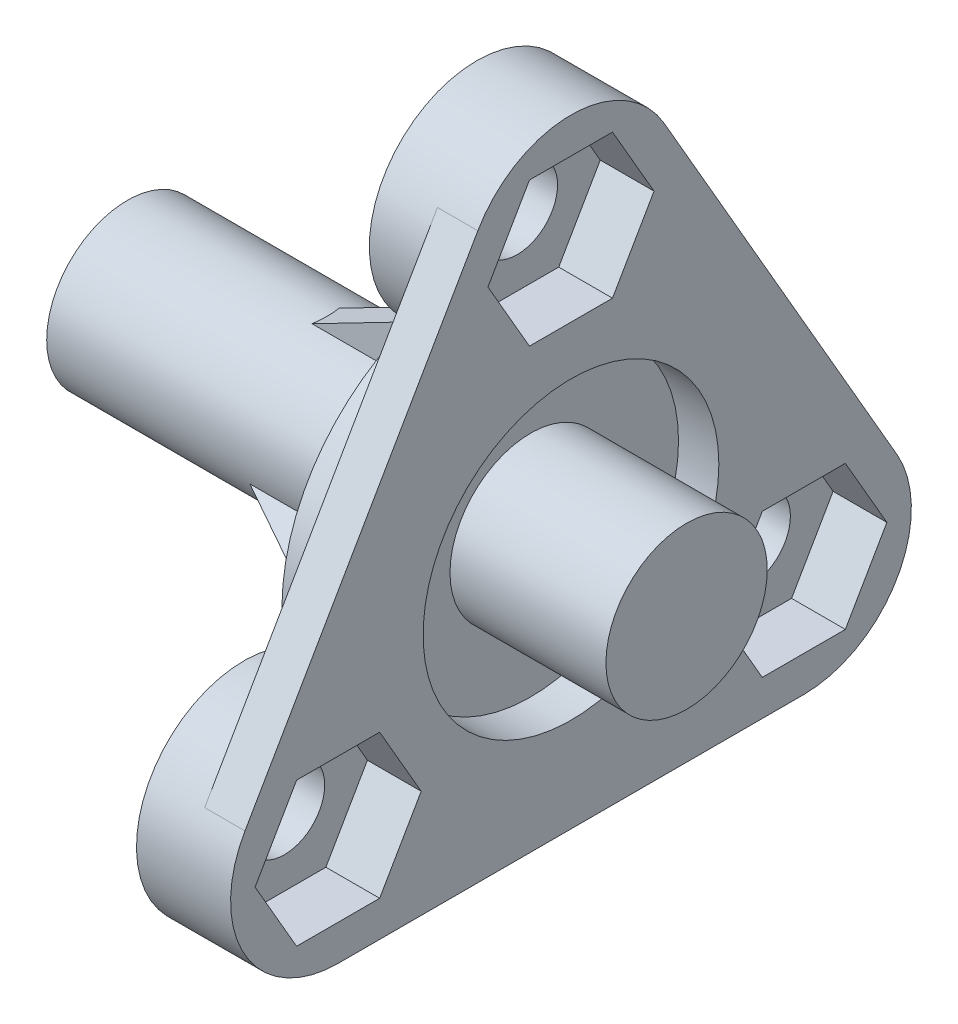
from build123d import *
from build123d.topology import SkipClean

# Parameters (mm, degrees)
ESQUISSE1_R                  = 1.5
ESQUISSE1_R_2                = 5.5
BOSS_EXTRU_1_DEPTH           = 1.5
BOSS_EXTRU_2_START           = 2
ESQUISSE7_R                  = 1.5
BOSS_EXTRU_2_DEPTH           = 2
BOSS_EXTRU_3_START           = 13
ESQUISSE9_R                  = 3
ESQUISSE9_R_2                = 1.5
BOSS_EXTRU_3_DEPTH           = 13
ENL_V_MAT_EXTRU_1_DEPTH      = 2
ESQUISSE11_R                 = 3
BOSS_EXTRU_4_DEPTH           = 5.8
BOSS_EXTRU_5_DEPTH           = 0.5
R_P_TITION_CIRCULAIRE1_COUNT = 3


with BuildPart() as part:
    # Esquisse1 → Boss.-Extru.1 (new body)
    with BuildSketch(Plane(origin=(0, 0, 0), x_dir=(0, 0, -1), z_dir=(1, 0, 0))):
        with BuildLine():
            Line((-3.464101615, 12), (-12.124355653, -3))
            ThreePointArc((-12.124355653, -3), (-12.124355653, -7), (-8.660254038, -9))
            Line((-8.660254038, -9), (8.660254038, -9))
            ThreePointArc((8.660254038, -9), (12.124355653, -7), (12.124355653, -3))
            Line((12.124355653, -3), (3.464101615, 12))
            ThreePointArc((3.464101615, 12), (0, 14), (-3.464101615, 12))
        make_face()
        with Locations((0, 10)):
            Circle(ESQUISSE1_R, mode=Mode.SUBTRACT)
        with Locations((8.660254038, -5)):
            Circle(ESQUISSE1_R, mode=Mode.SUBTRACT)
        with Locations((-8.660254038, -5)):
            Circle(ESQUISSE1_R, mode=Mode.SUBTRACT)
        Circle(ESQUISSE1_R_2, mode=Mode.SUBTRACT)
    extrude(amount=BOSS_EXTRU_1_DEPTH)

    # Esquisse7 → Boss.-Extru.2 (add)
    with SkipClean():  # the faces are left unmerged after this step: merging them gives an invalid solid
        with BuildSketch(Plane.ZY.offset(BOSS_EXTRU_2_START)):
            with BuildLine():
                ThreePointArc((7.131854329, -1.30351595), (6.278684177, 3.625), (2.437049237, 6.828125))
                ThreePointArc((2.437049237, 6.828125), (0, 14), (-2.437049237, 6.828125))
                ThreePointArc((-2.437049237, 6.828125), (-6.278684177, 3.625), (-7.131854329, -1.30351595))
                ThreePointArc((-7.131854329, -1.30351595), (-12.124355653, -7), (-4.694805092, -5.52460905))
                ThreePointArc((-4.694805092, -5.52460905), (0, -7.25), (4.694805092, -5.52460905))
                ThreePointArc((4.694805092, -5.52460905), (12.124355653, -7), (7.131854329, -1.30351595))
            make_face()
            Circle(ESQUISSE7_R, mode=Mode.SUBTRACT)
            with Locations((0, 10)):
                Circle(ESQUISSE7_R, mode=Mode.SUBTRACT)
            with Locations((8.660254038, -5)):
                Circle(ESQUISSE7_R, mode=Mode.SUBTRACT)
            with Locations((-8.660254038, -5)):
                Circle(ESQUISSE7_R, mode=Mode.SUBTRACT)
        extrude(amount=-BOSS_EXTRU_2_DEPTH)

    # Esquisse9 → Boss.-Extru.3 (add)
    with SkipClean():  # the faces are left unmerged after this step: merging them gives an invalid solid
        with BuildSketch(Plane.ZY.offset(2).offset(BOSS_EXTRU_3_START)):
            with Locations(Location((0, 0, 0), (0, 0, 180))):
                Circle(ESQUISSE9_R)
            Circle(ESQUISSE9_R_2, mode=Mode.SUBTRACT)
        extrude(amount=-BOSS_EXTRU_3_DEPTH)

    # Esquisse10 → Enl_v. mat.-Extru.1 (cut)
    with SkipClean():  # the faces are left unmerged after this step: merging them gives an invalid solid
        with BuildSketch(Plane(origin=(1.5, 0, 0), x_dir=(0, 0, -1), z_dir=(1, 0, 0))):
            Polygon((3.08882394, 10), (1.54441197, 12.675), (-1.54441197, 12.675), (-3.08882394, 10), (-1.54441197, 7.325), (1.54441197, 7.325), align=None)
            Polygon((11.749077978, -5), (10.204666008, -2.325), (7.115842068, -2.325), (5.571430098, -5), (7.115842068, -7.675), (10.204666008, -7.675), align=None)
            Polygon((-5.571430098, -5), (-7.115842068, -2.325), (-10.204666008, -2.325), (-11.749077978, -5), (-10.204666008, -7.675), (-7.115842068, -7.675), align=None)
        extrude(amount=-ENL_V_MAT_EXTRU_1_DEPTH, mode=Mode.SUBTRACT)

    # Esquisse11 → Boss.-Extru.4 (add)
    with SkipClean():  # the faces are left unmerged after this step: merging them gives an invalid solid
        with BuildSketch(Plane(origin=(0, 0, 0), x_dir=(0, 0, -1), z_dir=(1, 0, 0))):
            Circle(ESQUISSE11_R)
        extrude(amount=BOSS_EXTRU_4_DEPTH)

    # Esquisse12 → Boss.-Extru.5 (add, symmetric)
    with SkipClean():  # the faces are left unmerged after this step: merging them gives an invalid solid
        with BuildSketch(Plane.XY):
            Polygon((-8, 2.767232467), (-2, 5.867232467), (-2, 2.767232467), align=None)
        boss_extru_5 = extrude(amount=BOSS_EXTRU_5_DEPTH, both=True)

    # R_p_tition circulaire1: Boss.-Extru.5 ×3 about axis
    with SkipClean():  # the faces are left unmerged after this step: merging them gives an invalid solid
        r_p_tition_circulaire1_axis = Axis((0, 0, 0), (1, 0, 0))
        for i in range(1, R_P_TITION_CIRCULAIRE1_COUNT):
            add(boss_extru_5.rotate(r_p_tition_circulaire1_axis, i * 360 / R_P_TITION_CIRCULAIRE1_COUNT))


solid = part.part
